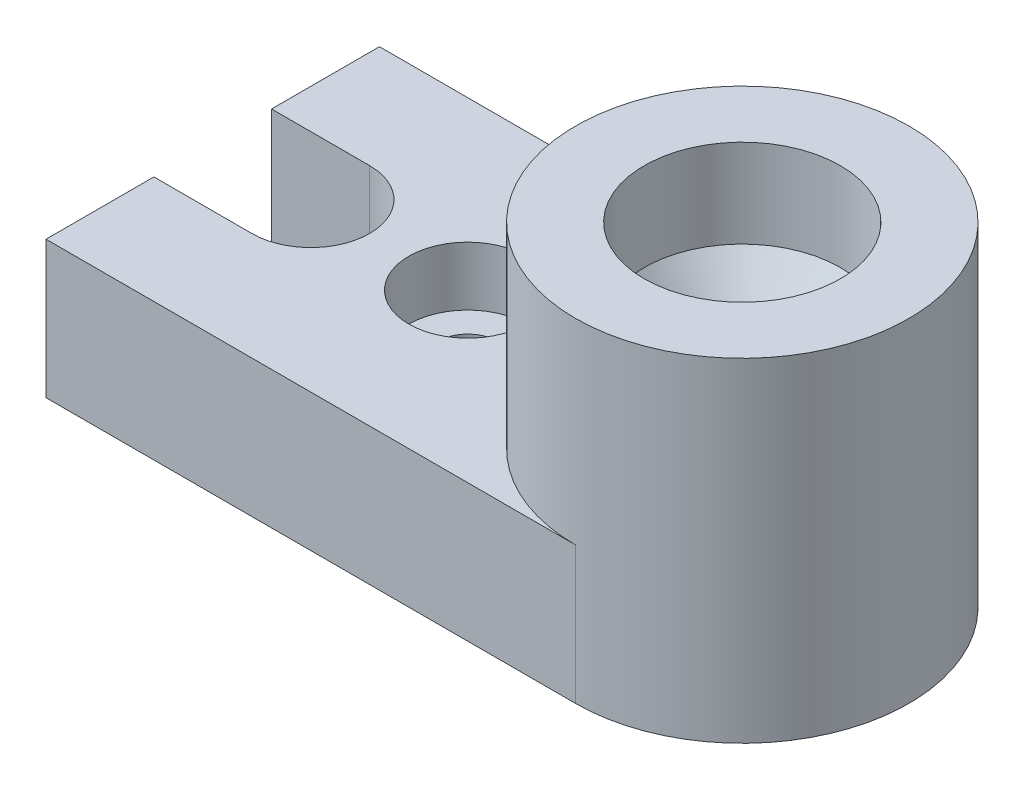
ISO-10303-21;
HEADER;
FILE_DESCRIPTION(('STEP AP214'),'2;1');
FILE_NAME('part.step','',(''),(''),'','','');
FILE_SCHEMA(('AUTOMOTIVE_DESIGN { 1 0 10303 214 1 1 1 1 }'));
ENDSEC;
DATA;
#1=APPLICATION_CONTEXT('core data for automotive mechanical design processes');
#2=APPLICATION_PROTOCOL_DEFINITION('international standard','automotive_design',2000,#1);
#3=PRODUCT_CONTEXT('',#1,'mechanical');
#4=PRODUCT('Part','Part','',(#3));
#5=PRODUCT_RELATED_PRODUCT_CATEGORY('part','',(#4));
#6=PRODUCT_DEFINITION_FORMATION('','',#4);
#7=PRODUCT_DEFINITION_CONTEXT('part definition',#1,'design');
#8=PRODUCT_DEFINITION('design','',#6,#7);
#9=PRODUCT_DEFINITION_SHAPE('','',#8);
#10=(LENGTH_UNIT() NAMED_UNIT(*) SI_UNIT(.MILLI.,.METRE.));
#11=(NAMED_UNIT(*) PLANE_ANGLE_UNIT() SI_UNIT($,.RADIAN.));
#12=(NAMED_UNIT(*) SI_UNIT($,.STERADIAN.) SOLID_ANGLE_UNIT());
#13=UNCERTAINTY_MEASURE_WITH_UNIT(LENGTH_MEASURE(1.E-05),#10,'distance_accuracy_value','');
#14=(GEOMETRIC_REPRESENTATION_CONTEXT(3) GLOBAL_UNCERTAINTY_ASSIGNED_CONTEXT((#13)) GLOBAL_UNIT_ASSIGNED_CONTEXT((#10,
#11,#12)) REPRESENTATION_CONTEXT('',''));
#15=CARTESIAN_POINT('',(0.,0.,0.));
#16=DIRECTION('',(0.,0.,1.));
#17=DIRECTION('',(1.,0.,0.));
#18=AXIS2_PLACEMENT_3D('',#15,#16,#17);
#19=CARTESIAN_POINT('',(-28.,14.,0.));
#20=DIRECTION('',(0.,-1.,0.));
#21=DIRECTION('',(0.,0.,-1.));
#22=AXIS2_PLACEMENT_3D('',#19,#20,#21);
#23=CYLINDRICAL_SURFACE('',#22,3.);
#24=CARTESIAN_POINT('',(-28.,0.,0.));
#25=DIRECTION('',(0.,1.,0.));
#26=DIRECTION('',(0.,0.,1.));
#27=AXIS2_PLACEMENT_3D('',#24,#25,#26);
#28=CIRCLE('',#27,3.);
#29=CARTESIAN_POINT('',(-28.,0.,3.));
#30=VERTEX_POINT('',#29);
#31=EDGE_CURVE('E135',#30,#30,#28,.T.);
#32=ORIENTED_EDGE('',*,*,#31,.F.);
#33=EDGE_LOOP('',(#32));
#34=FACE_BOUND('',#33,.T.);
#35=CARTESIAN_POINT('',(-28.,8.,0.));
#36=DIRECTION('',(0.,1.,0.));
#37=DIRECTION('',(0.,0.,1.));
#38=AXIS2_PLACEMENT_3D('',#35,#36,#37);
#39=CIRCLE('',#38,3.);
#40=CARTESIAN_POINT('',(-28.,8.,3.));
#41=VERTEX_POINT('',#40);
#42=EDGE_CURVE('E35',#41,#41,#39,.T.);
#43=ORIENTED_EDGE('',*,*,#42,.T.);
#44=EDGE_LOOP('',(#43));
#45=FACE_BOUND('',#44,.T.);
#46=ADVANCED_FACE('F31',(#34,#45),#23,.F.);
#47=CARTESIAN_POINT('',(0.,0.,0.));
#48=DIRECTION('',(0.,1.,0.));
#49=DIRECTION('',(0.,0.,1.));
#50=AXIS2_PLACEMENT_3D('',#47,#48,#49);
#51=PLANE('',#50);
#52=ORIENTED_EDGE('',*,*,#31,.T.);
#53=EDGE_LOOP('',(#52));
#54=FACE_BOUND('',#53,.T.);
#55=CARTESIAN_POINT('',(0.,0.,0.));
#56=DIRECTION('',(0.,1.,0.));
#57=DIRECTION('',(0.,0.,1.));
#58=AXIS2_PLACEMENT_3D('',#55,#56,#57);
#59=CIRCLE('',#58,17.);
#60=CARTESIAN_POINT('',(0.,0.,17.));
#61=VERTEX_POINT('',#60);
#62=CARTESIAN_POINT('',(0.,0.,-17.));
#63=VERTEX_POINT('',#62);
#64=EDGE_CURVE('E131',#61,#63,#59,.T.);
#65=ORIENTED_EDGE('',*,*,#64,.F.);
#66=DIRECTION('',(1.,0.,0.));
#67=VECTOR('',#66,1.);
#68=CARTESIAN_POINT('',(0.,0.,17.));
#69=LINE('',#68,#67);
#70=CARTESIAN_POINT('',(-54.,0.,17.));
#71=VERTEX_POINT('',#70);
#72=EDGE_CURVE('E86',#71,#61,#69,.T.);
#73=ORIENTED_EDGE('',*,*,#72,.F.);
#74=DIRECTION('',(0.,0.,1.));
#75=VECTOR('',#74,1.);
#76=CARTESIAN_POINT('',(-54.,0.,17.));
#77=LINE('',#76,#75);
#78=CARTESIAN_POINT('',(-54.,0.,6.));
#79=VERTEX_POINT('',#78);
#80=EDGE_CURVE('E79',#79,#71,#77,.T.);
#81=ORIENTED_EDGE('',*,*,#80,.F.);
#82=DIRECTION('',(-1.,0.,0.));
#83=VECTOR('',#82,1.);
#84=CARTESIAN_POINT('',(-54.,0.,6.));
#85=LINE('',#84,#83);
#86=CARTESIAN_POINT('',(-44.,0.,6.));
#87=VERTEX_POINT('',#86);
#88=EDGE_CURVE('E142',#87,#79,#85,.T.);
#89=ORIENTED_EDGE('',*,*,#88,.F.);
#90=CARTESIAN_POINT('',(-44.,0.,0.));
#91=DIRECTION('',(0.,-1.,0.));
#92=DIRECTION('',(0.,0.,1.));
#93=AXIS2_PLACEMENT_3D('',#90,#91,#92);
#94=CIRCLE('',#93,6.);
#95=CARTESIAN_POINT('',(-44.,0.,-6.));
#96=VERTEX_POINT('',#95);
#97=EDGE_CURVE('E119',#96,#87,#94,.T.);
#98=ORIENTED_EDGE('',*,*,#97,.F.);
#99=DIRECTION('',(1.,0.,0.));
#100=VECTOR('',#99,1.);
#101=CARTESIAN_POINT('',(-44.,0.,-6.));
#102=LINE('',#101,#100);
#103=CARTESIAN_POINT('',(-54.,0.,-6.));
#104=VERTEX_POINT('',#103);
#105=EDGE_CURVE('E139',#104,#96,#102,.T.);
#106=ORIENTED_EDGE('',*,*,#105,.F.);
#107=DIRECTION('',(0.,0.,1.));
#108=VECTOR('',#107,1.);
#109=CARTESIAN_POINT('',(-54.,0.,-6.));
#110=LINE('',#109,#108);
#111=CARTESIAN_POINT('',(-54.,0.,-17.));
#112=VERTEX_POINT('',#111);
#113=EDGE_CURVE('E137',#112,#104,#110,.T.);
#114=ORIENTED_EDGE('',*,*,#113,.F.);
#115=DIRECTION('',(-1.,0.,0.));
#116=VECTOR('',#115,1.);
#117=CARTESIAN_POINT('',(-54.,0.,-17.));
#118=LINE('',#117,#116);
#119=EDGE_CURVE('E134',#63,#112,#118,.T.);
#120=ORIENTED_EDGE('',*,*,#119,.F.);
#121=EDGE_LOOP('',(#65,#73,#81,#89,#98,#106,#114,#120));
#122=FACE_BOUND('',#121,.T.);
#123=CARTESIAN_POINT('',(0.,0.,0.));
#124=DIRECTION('',(0.,1.,0.));
#125=DIRECTION('',(0.,0.,1.));
#126=AXIS2_PLACEMENT_3D('',#123,#124,#125);
#127=CIRCLE('',#126,4.84922787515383);
#128=CARTESIAN_POINT('',(0.,0.,4.84922787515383));
#129=VERTEX_POINT('',#128);
#130=EDGE_CURVE('E196',#129,#129,#127,.T.);
#131=ORIENTED_EDGE('',*,*,#130,.T.);
#132=EDGE_LOOP('',(#131));
#133=FACE_BOUND('',#132,.T.);
#134=ADVANCED_FACE('F179',(#54,#122,#133),#51,.F.);
#135=CARTESIAN_POINT('',(0.,34.,0.));
#136=DIRECTION('',(0.,1.,0.));
#137=DIRECTION('',(0.,0.,1.));
#138=AXIS2_PLACEMENT_3D('',#135,#136,#137);
#139=PLANE('',#138);
#140=CARTESIAN_POINT('',(0.,34.,0.));
#141=DIRECTION('',(0.,1.,0.));
#142=DIRECTION('',(0.,0.,1.));
#143=AXIS2_PLACEMENT_3D('',#140,#141,#142);
#144=CIRCLE('',#143,17.);
#145=CARTESIAN_POINT('',(0.,34.,17.));
#146=VERTEX_POINT('',#145);
#147=EDGE_CURVE('E193',#146,#146,#144,.T.);
#148=ORIENTED_EDGE('',*,*,#147,.T.);
#149=EDGE_LOOP('',(#148));
#150=FACE_BOUND('',#149,.T.);
#151=CARTESIAN_POINT('',(0.,34.,0.));
#152=DIRECTION('',(0.,1.,0.));
#153=DIRECTION('',(0.,0.,1.));
#154=AXIS2_PLACEMENT_3D('',#151,#152,#153);
#155=CIRCLE('',#154,10.);
#156=CARTESIAN_POINT('',(0.,34.,10.));
#157=VERTEX_POINT('',#156);
#158=EDGE_CURVE('E205',#157,#157,#155,.T.);
#159=ORIENTED_EDGE('',*,*,#158,.F.);
#160=EDGE_LOOP('',(#159));
#161=FACE_BOUND('',#160,.T.);
#162=ADVANCED_FACE('F235',(#150,#161),#139,.T.);
#163=CARTESIAN_POINT('',(0.,14.,0.));
#164=DIRECTION('',(0.,1.,0.));
#165=DIRECTION('',(0.,0.,1.));
#166=AXIS2_PLACEMENT_3D('',#163,#164,#165);
#167=PLANE('',#166);
#168=CARTESIAN_POINT('',(-28.,14.,0.));
#169=DIRECTION('',(0.,1.,0.));
#170=DIRECTION('',(0.,0.,1.));
#171=AXIS2_PLACEMENT_3D('',#168,#169,#170);
#172=CIRCLE('',#171,6.);
#173=CARTESIAN_POINT('',(-28.,14.,6.));
#174=VERTEX_POINT('',#173);
#175=EDGE_CURVE('E208',#174,#174,#172,.T.);
#176=ORIENTED_EDGE('',*,*,#175,.F.);
#177=EDGE_LOOP('',(#176));
#178=FACE_BOUND('',#177,.T.);
#179=CARTESIAN_POINT('',(0.,14.,0.));
#180=DIRECTION('',(0.,1.,0.));
#181=DIRECTION('',(0.,0.,1.));
#182=AXIS2_PLACEMENT_3D('',#179,#180,#181);
#183=CIRCLE('',#182,17.);
#184=CARTESIAN_POINT('',(0.,14.,-17.));
#185=VERTEX_POINT('',#184);
#186=CARTESIAN_POINT('',(0.,14.,17.));
#187=VERTEX_POINT('',#186);
#188=EDGE_CURVE('E11',#185,#187,#183,.T.);
#189=ORIENTED_EDGE('',*,*,#188,.F.);
#190=DIRECTION('',(-1.,0.,0.));
#191=VECTOR('',#190,1.);
#192=CARTESIAN_POINT('',(-54.,14.,-17.));
#193=LINE('',#192,#191);
#194=CARTESIAN_POINT('',(-54.,14.,-17.));
#195=VERTEX_POINT('',#194);
#196=EDGE_CURVE('E146',#185,#195,#193,.T.);
#197=ORIENTED_EDGE('',*,*,#196,.T.);
#198=DIRECTION('',(0.,0.,1.));
#199=VECTOR('',#198,1.);
#200=CARTESIAN_POINT('',(-54.,14.,-6.));
#201=LINE('',#200,#199);
#202=CARTESIAN_POINT('',(-54.,14.,-6.));
#203=VERTEX_POINT('',#202);
#204=EDGE_CURVE('E166',#195,#203,#201,.T.);
#205=ORIENTED_EDGE('',*,*,#204,.T.);
#206=DIRECTION('',(1.,0.,0.));
#207=VECTOR('',#206,1.);
#208=CARTESIAN_POINT('',(-44.,14.,-6.));
#209=LINE('',#208,#207);
#210=CARTESIAN_POINT('',(-44.,14.,-6.));
#211=VERTEX_POINT('',#210);
#212=EDGE_CURVE('E110',#203,#211,#209,.T.);
#213=ORIENTED_EDGE('',*,*,#212,.T.);
#214=CARTESIAN_POINT('',(-44.,14.,0.));
#215=DIRECTION('',(0.,-1.,0.));
#216=DIRECTION('',(0.,0.,1.));
#217=AXIS2_PLACEMENT_3D('',#214,#215,#216);
#218=CIRCLE('',#217,6.);
#219=CARTESIAN_POINT('',(-44.,14.,6.));
#220=VERTEX_POINT('',#219);
#221=EDGE_CURVE('E103',#211,#220,#218,.T.);
#222=ORIENTED_EDGE('',*,*,#221,.T.);
#223=DIRECTION('',(-1.,0.,0.));
#224=VECTOR('',#223,1.);
#225=CARTESIAN_POINT('',(-54.,14.,6.));
#226=LINE('',#225,#224);
#227=CARTESIAN_POINT('',(-54.,14.,6.));
#228=VERTEX_POINT('',#227);
#229=EDGE_CURVE('E107',#220,#228,#226,.T.);
#230=ORIENTED_EDGE('',*,*,#229,.T.);
#231=DIRECTION('',(0.,0.,1.));
#232=VECTOR('',#231,1.);
#233=CARTESIAN_POINT('',(-54.,14.,17.));
#234=LINE('',#233,#232);
#235=CARTESIAN_POINT('',(-54.,14.,17.));
#236=VERTEX_POINT('',#235);
#237=EDGE_CURVE('E50',#228,#236,#234,.T.);
#238=ORIENTED_EDGE('',*,*,#237,.T.);
#239=DIRECTION('',(1.,0.,0.));
#240=VECTOR('',#239,1.);
#241=CARTESIAN_POINT('',(0.,14.,17.));
#242=LINE('',#241,#240);
#243=EDGE_CURVE('E127',#236,#187,#242,.T.);
#244=ORIENTED_EDGE('',*,*,#243,.T.);
#245=EDGE_LOOP('',(#189,#197,#205,#213,#222,#230,#238,#244));
#246=FACE_BOUND('',#245,.T.);
#247=ADVANCED_FACE('F105',(#178,#246),#167,.T.);
#248=CARTESIAN_POINT('',(0.,14.,0.));
#249=DIRECTION('',(0.,-1.,0.));
#250=DIRECTION('',(0.,0.,-1.));
#251=AXIS2_PLACEMENT_3D('',#248,#249,#250);
#252=CYLINDRICAL_SURFACE('',#251,17.);
#253=ORIENTED_EDGE('',*,*,#64,.T.);
#254=DIRECTION('',(0.,-1.,0.));
#255=VECTOR('',#254,1.);
#256=CARTESIAN_POINT('',(0.,14.,-17.));
#257=LINE('',#256,#255);
#258=EDGE_CURVE('E41',#185,#63,#257,.T.);
#259=ORIENTED_EDGE('',*,*,#258,.F.);
#260=ORIENTED_EDGE('',*,*,#188,.T.);
#261=DIRECTION('',(0.,-1.,0.));
#262=VECTOR('',#261,1.);
#263=CARTESIAN_POINT('',(0.,14.,17.));
#264=LINE('',#263,#262);
#265=EDGE_CURVE('E149',#187,#61,#264,.T.);
#266=ORIENTED_EDGE('',*,*,#265,.T.);
#267=EDGE_LOOP('',(#253,#259,#260,#266));
#268=FACE_BOUND('',#267,.T.);
#269=ORIENTED_EDGE('',*,*,#147,.F.);
#270=EDGE_LOOP('',(#269));
#271=FACE_BOUND('',#270,.T.);
#272=ADVANCED_FACE('F33',(#268,#271),#252,.T.);
#273=CARTESIAN_POINT('',(-54.,14.,-17.));
#274=DIRECTION('',(0.,0.,1.));
#275=DIRECTION('',(1.,0.,0.));
#276=AXIS2_PLACEMENT_3D('',#273,#274,#275);
#277=PLANE('',#276);
#278=ORIENTED_EDGE('',*,*,#119,.T.);
#279=DIRECTION('',(0.,-1.,0.));
#280=VECTOR('',#279,1.);
#281=CARTESIAN_POINT('',(-54.,14.,-17.));
#282=LINE('',#281,#280);
#283=EDGE_CURVE('E155',#195,#112,#282,.T.);
#284=ORIENTED_EDGE('',*,*,#283,.F.);
#285=ORIENTED_EDGE('',*,*,#196,.F.);
#286=ORIENTED_EDGE('',*,*,#258,.T.);
#287=EDGE_LOOP('',(#278,#284,#285,#286));
#288=FACE_BOUND('',#287,.T.);
#289=ADVANCED_FACE('F173',(#288),#277,.F.);
#290=CARTESIAN_POINT('',(-54.,14.,-6.));
#291=DIRECTION('',(1.,0.,0.));
#292=DIRECTION('',(0.,0.,-1.));
#293=AXIS2_PLACEMENT_3D('',#290,#291,#292);
#294=PLANE('',#293);
#295=ORIENTED_EDGE('',*,*,#113,.T.);
#296=DIRECTION('',(0.,-1.,0.));
#297=VECTOR('',#296,1.);
#298=CARTESIAN_POINT('',(-54.,14.,-6.));
#299=LINE('',#298,#297);
#300=EDGE_CURVE('E152',#203,#104,#299,.T.);
#301=ORIENTED_EDGE('',*,*,#300,.F.);
#302=ORIENTED_EDGE('',*,*,#204,.F.);
#303=ORIENTED_EDGE('',*,*,#283,.T.);
#304=EDGE_LOOP('',(#295,#301,#302,#303));
#305=FACE_BOUND('',#304,.T.);
#306=ADVANCED_FACE('F185',(#305),#294,.F.);
#307=CARTESIAN_POINT('',(-44.,14.,-6.));
#308=DIRECTION('',(0.,0.,-1.));
#309=DIRECTION('',(-1.,0.,0.));
#310=AXIS2_PLACEMENT_3D('',#307,#308,#309);
#311=PLANE('',#310);
#312=ORIENTED_EDGE('',*,*,#105,.T.);
#313=DIRECTION('',(0.,-1.,0.));
#314=VECTOR('',#313,1.);
#315=CARTESIAN_POINT('',(-44.,14.,-6.));
#316=LINE('',#315,#314);
#317=EDGE_CURVE('E122',#211,#96,#316,.T.);
#318=ORIENTED_EDGE('',*,*,#317,.F.);
#319=ORIENTED_EDGE('',*,*,#212,.F.);
#320=ORIENTED_EDGE('',*,*,#300,.T.);
#321=EDGE_LOOP('',(#312,#318,#319,#320));
#322=FACE_BOUND('',#321,.T.);
#323=ADVANCED_FACE('F188',(#322),#311,.F.);
#324=CARTESIAN_POINT('',(-44.,14.,0.));
#325=DIRECTION('',(0.,-1.,0.));
#326=DIRECTION('',(0.,0.,-1.));
#327=AXIS2_PLACEMENT_3D('',#324,#325,#326);
#328=CYLINDRICAL_SURFACE('',#327,6.);
#329=ORIENTED_EDGE('',*,*,#97,.T.);
#330=DIRECTION('',(0.,-1.,0.));
#331=VECTOR('',#330,1.);
#332=CARTESIAN_POINT('',(-44.,14.,6.));
#333=LINE('',#332,#331);
#334=EDGE_CURVE('E116',#220,#87,#333,.T.);
#335=ORIENTED_EDGE('',*,*,#334,.F.);
#336=ORIENTED_EDGE('',*,*,#221,.F.);
#337=ORIENTED_EDGE('',*,*,#317,.T.);
#338=EDGE_LOOP('',(#329,#335,#336,#337));
#339=FACE_BOUND('',#338,.T.);
#340=ADVANCED_FACE('F117',(#339),#328,.F.);
#341=CARTESIAN_POINT('',(-54.,14.,6.));
#342=DIRECTION('',(0.,0.,1.));
#343=DIRECTION('',(1.,0.,0.));
#344=AXIS2_PLACEMENT_3D('',#341,#342,#343);
#345=PLANE('',#344);
#346=ORIENTED_EDGE('',*,*,#88,.T.);
#347=DIRECTION('',(0.,-1.,0.));
#348=VECTOR('',#347,1.);
#349=CARTESIAN_POINT('',(-54.,14.,6.));
#350=LINE('',#349,#348);
#351=EDGE_CURVE('E123',#228,#79,#350,.T.);
#352=ORIENTED_EDGE('',*,*,#351,.F.);
#353=ORIENTED_EDGE('',*,*,#229,.F.);
#354=ORIENTED_EDGE('',*,*,#334,.T.);
#355=EDGE_LOOP('',(#346,#352,#353,#354));
#356=FACE_BOUND('',#355,.T.);
#357=ADVANCED_FACE('F125',(#356),#345,.F.);
#358=CARTESIAN_POINT('',(-54.,14.,17.));
#359=DIRECTION('',(1.,0.,0.));
#360=DIRECTION('',(0.,0.,-1.));
#361=AXIS2_PLACEMENT_3D('',#358,#359,#360);
#362=PLANE('',#361);
#363=ORIENTED_EDGE('',*,*,#80,.T.);
#364=DIRECTION('',(0.,-1.,0.));
#365=VECTOR('',#364,1.);
#366=CARTESIAN_POINT('',(-54.,14.,17.));
#367=LINE('',#366,#365);
#368=EDGE_CURVE('E147',#236,#71,#367,.T.);
#369=ORIENTED_EDGE('',*,*,#368,.F.);
#370=ORIENTED_EDGE('',*,*,#237,.F.);
#371=ORIENTED_EDGE('',*,*,#351,.T.);
#372=EDGE_LOOP('',(#363,#369,#370,#371));
#373=FACE_BOUND('',#372,.T.);
#374=ADVANCED_FACE('F249',(#373),#362,.F.);
#375=CARTESIAN_POINT('',(0.,14.,17.));
#376=DIRECTION('',(0.,0.,-1.));
#377=DIRECTION('',(-1.,0.,0.));
#378=AXIS2_PLACEMENT_3D('',#375,#376,#377);
#379=PLANE('',#378);
#380=ORIENTED_EDGE('',*,*,#72,.T.);
#381=ORIENTED_EDGE('',*,*,#265,.F.);
#382=ORIENTED_EDGE('',*,*,#243,.F.);
#383=ORIENTED_EDGE('',*,*,#368,.T.);
#384=EDGE_LOOP('',(#380,#381,#382,#383));
#385=FACE_BOUND('',#384,.T.);
#386=ADVANCED_FACE('F245',(#385),#379,.F.);
#387=CARTESIAN_POINT('',(0.,34.,0.));
#388=DIRECTION('',(0.,1.,0.));
#389=DIRECTION('',(0.,0.,1.));
#390=AXIS2_PLACEMENT_3D('',#387,#388,#389);
#391=CYLINDRICAL_SURFACE('',#390,4.84922787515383);
#392=CARTESIAN_POINT('',(0.,18.,0.));
#393=DIRECTION('',(0.,1.,0.));
#394=DIRECTION('',(0.,0.,1.));
#395=AXIS2_PLACEMENT_3D('',#392,#393,#394);
#396=CIRCLE('',#395,4.84922787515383);
#397=CARTESIAN_POINT('',(0.,18.,4.84922787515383));
#398=VERTEX_POINT('',#397);
#399=EDGE_CURVE('E199',#398,#398,#396,.T.);
#400=ORIENTED_EDGE('',*,*,#399,.T.);
#401=EDGE_LOOP('',(#400));
#402=FACE_BOUND('',#401,.T.);
#403=ORIENTED_EDGE('',*,*,#130,.F.);
#404=EDGE_LOOP('',(#403));
#405=FACE_BOUND('',#404,.T.);
#406=ADVANCED_FACE('F248',(#402,#405),#391,.F.);
#407=CARTESIAN_POINT('',(0.,18.,0.));
#408=DIRECTION('',(0.,1.,0.));
#409=DIRECTION('',(0.,0.,1.));
#410=AXIS2_PLACEMENT_3D('',#407,#408,#409);
#411=CONICAL_SURFACE('',#410,4.84922787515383,0.634366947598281);
#412=CARTESIAN_POINT('',(0.,25.,0.));
#413=DIRECTION('',(0.,1.,0.));
#414=DIRECTION('',(0.,0.,1.));
#415=AXIS2_PLACEMENT_3D('',#412,#413,#414);
#416=CIRCLE('',#415,10.);
#417=CARTESIAN_POINT('',(0.,25.,10.));
#418=VERTEX_POINT('',#417);
#419=EDGE_CURVE('E202',#418,#418,#416,.T.);
#420=ORIENTED_EDGE('',*,*,#419,.T.);
#421=EDGE_LOOP('',(#420));
#422=FACE_BOUND('',#421,.T.);
#423=ORIENTED_EDGE('',*,*,#399,.F.);
#424=EDGE_LOOP('',(#423));
#425=FACE_BOUND('',#424,.T.);
#426=ADVANCED_FACE('F338',(#422,#425),#411,.F.);
#427=CARTESIAN_POINT('',(0.,34.,0.));
#428=DIRECTION('',(0.,1.,0.));
#429=DIRECTION('',(0.,0.,1.));
#430=AXIS2_PLACEMENT_3D('',#427,#428,#429);
#431=CYLINDRICAL_SURFACE('',#430,10.);
#432=ORIENTED_EDGE('',*,*,#158,.T.);
#433=EDGE_LOOP('',(#432));
#434=FACE_BOUND('',#433,.T.);
#435=ORIENTED_EDGE('',*,*,#419,.F.);
#436=EDGE_LOOP('',(#435));
#437=FACE_BOUND('',#436,.T.);
#438=ADVANCED_FACE('F226',(#434,#437),#431,.F.);
#439=CARTESIAN_POINT('',(-28.,8.,0.));
#440=DIRECTION('',(0.,1.,0.));
#441=DIRECTION('',(0.,0.,1.));
#442=AXIS2_PLACEMENT_3D('',#439,#440,#441);
#443=CYLINDRICAL_SURFACE('',#442,6.);
#444=CARTESIAN_POINT('',(-28.,8.,0.));
#445=DIRECTION('',(0.,1.,0.));
#446=DIRECTION('',(0.,0.,1.));
#447=AXIS2_PLACEMENT_3D('',#444,#445,#446);
#448=CIRCLE('',#447,6.);
#449=CARTESIAN_POINT('',(-28.,8.,6.));
#450=VERTEX_POINT('',#449);
#451=EDGE_CURVE('E211',#450,#450,#448,.T.);
#452=ORIENTED_EDGE('',*,*,#451,.F.);
#453=EDGE_LOOP('',(#452));
#454=FACE_BOUND('',#453,.T.);
#455=ORIENTED_EDGE('',*,*,#175,.T.);
#456=EDGE_LOOP('',(#455));
#457=FACE_BOUND('',#456,.T.);
#458=ADVANCED_FACE('F221',(#454,#457),#443,.F.);
#459=CARTESIAN_POINT('',(-28.,8.,0.));
#460=DIRECTION('',(0.,1.,0.));
#461=DIRECTION('',(0.,0.,1.));
#462=AXIS2_PLACEMENT_3D('',#459,#460,#461);
#463=PLANE('',#462);
#464=ORIENTED_EDGE('',*,*,#42,.F.);
#465=EDGE_LOOP('',(#464));
#466=FACE_BOUND('',#465,.T.);
#467=ORIENTED_EDGE('',*,*,#451,.T.);
#468=EDGE_LOOP('',(#467));
#469=FACE_BOUND('',#468,.T.);
#470=ADVANCED_FACE('F219',(#466,#469),#463,.T.);
#471=CLOSED_SHELL('',(#46,#134,#162,#247,#272,#289,#306,#323,#340,#357,#374,#386,#406,#426,#438,
#458,#470));
#472=MANIFOLD_SOLID_BREP('B2',#471);
#473=ADVANCED_BREP_SHAPE_REPRESENTATION('',(#18,#472),#14);
#474=SHAPE_DEFINITION_REPRESENTATION(#9,#473);
ENDSEC;
END-ISO-10303-21;
